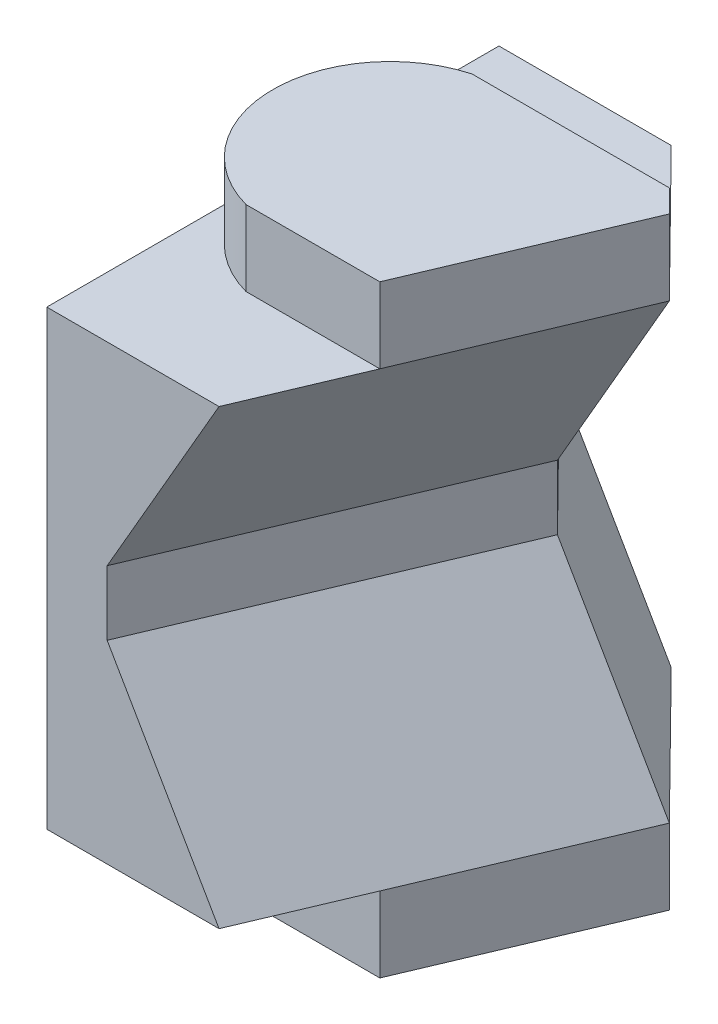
ISO-10303-21;
HEADER;
FILE_DESCRIPTION(('STEP AP214'),'2;1');
FILE_NAME('part.step','',(''),(''),'','','');
FILE_SCHEMA(('AUTOMOTIVE_DESIGN { 1 0 10303 214 1 1 1 1 }'));
ENDSEC;
DATA;
#1=APPLICATION_CONTEXT('core data for automotive mechanical design processes');
#2=APPLICATION_PROTOCOL_DEFINITION('international standard','automotive_design',2000,#1);
#3=PRODUCT_CONTEXT('',#1,'mechanical');
#4=PRODUCT('Part','Part','',(#3));
#5=PRODUCT_RELATED_PRODUCT_CATEGORY('part','',(#4));
#6=PRODUCT_DEFINITION_FORMATION('','',#4);
#7=PRODUCT_DEFINITION_CONTEXT('part definition',#1,'design');
#8=PRODUCT_DEFINITION('design','',#6,#7);
#9=PRODUCT_DEFINITION_SHAPE('','',#8);
#10=(LENGTH_UNIT() NAMED_UNIT(*) SI_UNIT(.MILLI.,.METRE.));
#11=(NAMED_UNIT(*) PLANE_ANGLE_UNIT() SI_UNIT($,.RADIAN.));
#12=(NAMED_UNIT(*) SI_UNIT($,.STERADIAN.) SOLID_ANGLE_UNIT());
#13=UNCERTAINTY_MEASURE_WITH_UNIT(LENGTH_MEASURE(1.E-05),#10,'distance_accuracy_value','');
#14=(GEOMETRIC_REPRESENTATION_CONTEXT(3) GLOBAL_UNCERTAINTY_ASSIGNED_CONTEXT((#13)) GLOBAL_UNIT_ASSIGNED_CONTEXT((#10,
#11,#12)) REPRESENTATION_CONTEXT('',''));
#15=CARTESIAN_POINT('',(0.,0.,0.));
#16=DIRECTION('',(0.,0.,1.));
#17=DIRECTION('',(1.,0.,0.));
#18=AXIS2_PLACEMENT_3D('',#15,#16,#17);
#19=CARTESIAN_POINT('',(0.,21.,42.));
#20=DIRECTION('',(0.,-1.,0.));
#21=DIRECTION('',(0.,0.,1.));
#22=AXIS2_PLACEMENT_3D('',#19,#20,#21);
#23=PLANE('',#22);
#24=DIRECTION('',(-0.389123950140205,0.,0.921185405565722));
#25=VECTOR('',#24,1.);
#26=CARTESIAN_POINT('',(28.4209180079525,21.,12.5955688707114));
#27=LINE('',#26,#25);
#28=CARTESIAN_POINT('',(16.,21.,42.));
#29=VERTEX_POINT('',#28);
#30=CARTESIAN_POINT('',(20.4353736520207,21.,31.5));
#31=VERTEX_POINT('',#30);
#32=EDGE_CURVE('E276',#29,#31,#27,.F.);
#33=ORIENTED_EDGE('',*,*,#32,.T.);
#34=DIRECTION('',(-1.,0.,0.));
#35=VECTOR('',#34,1.);
#36=CARTESIAN_POINT('',(8.,21.,31.5));
#37=LINE('',#36,#35);
#38=CARTESIAN_POINT('',(8.,21.,31.5));
#39=VERTEX_POINT('',#38);
#40=EDGE_CURVE('E250',#31,#39,#37,.T.);
#41=ORIENTED_EDGE('',*,*,#40,.T.);
#42=CARTESIAN_POINT('',(10.8906249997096,21.,21.));
#43=DIRECTION('',(0.,-1.,0.));
#44=DIRECTION('',(0.,0.,-1.));
#45=AXIS2_PLACEMENT_3D('',#42,#43,#44);
#46=CIRCLE('',#45,10.8906249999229);
#47=CARTESIAN_POINT('',(-2.133310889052E-10,21.,21.));
#48=VERTEX_POINT('',#47);
#49=EDGE_CURVE('E25',#39,#48,#46,.T.);
#50=ORIENTED_EDGE('',*,*,#49,.T.);
#51=DIRECTION('',(0.,0.,1.));
#52=VECTOR('',#51,1.);
#53=CARTESIAN_POINT('',(0.,21.,42.));
#54=LINE('',#53,#52);
#55=CARTESIAN_POINT('',(0.,21.,42.));
#56=VERTEX_POINT('',#55);
#57=EDGE_CURVE('E204',#48,#56,#54,.T.);
#58=ORIENTED_EDGE('',*,*,#57,.T.);
#59=DIRECTION('',(-1.,0.,0.));
#60=VECTOR('',#59,1.);
#61=CARTESIAN_POINT('',(0.,21.,42.));
#62=LINE('',#61,#60);
#63=EDGE_CURVE('E231',#56,#29,#62,.F.);
#64=ORIENTED_EDGE('',*,*,#63,.T.);
#65=EDGE_LOOP('',(#33,#41,#50,#58,#64));
#66=FACE_BOUND('',#65,.T.);
#67=ADVANCED_FACE('F14',(#66),#23,.F.);
#68=CARTESIAN_POINT('',(0.,-21.,42.));
#69=DIRECTION('',(0.,1.,0.));
#70=DIRECTION('',(0.,0.,1.));
#71=AXIS2_PLACEMENT_3D('',#68,#69,#70);
#72=PLANE('',#71);
#73=DIRECTION('',(1.,0.,0.));
#74=VECTOR('',#73,1.);
#75=CARTESIAN_POINT('',(8.,-21.,10.5));
#76=LINE('',#75,#74);
#77=CARTESIAN_POINT('',(8.,-21.,10.5));
#78=VERTEX_POINT('',#77);
#79=CARTESIAN_POINT('',(26.354406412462,-21.,10.5));
#80=VERTEX_POINT('',#79);
#81=EDGE_CURVE('E40',#78,#80,#76,.T.);
#82=ORIENTED_EDGE('',*,*,#81,.F.);
#83=CARTESIAN_POINT('',(10.8906249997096,-21.,21.));
#84=DIRECTION('',(0.,-1.,0.));
#85=DIRECTION('',(0.,0.,-1.));
#86=AXIS2_PLACEMENT_3D('',#83,#84,#85);
#87=CIRCLE('',#86,10.8906249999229);
#88=CARTESIAN_POINT('',(0.,-21.,21.));
#89=VERTEX_POINT('',#88);
#90=EDGE_CURVE('E23',#89,#78,#87,.T.);
#91=ORIENTED_EDGE('',*,*,#90,.F.);
#92=DIRECTION('',(0.,0.,-1.));
#93=VECTOR('',#92,1.);
#94=CARTESIAN_POINT('',(0.,-21.,42.));
#95=LINE('',#94,#93);
#96=CARTESIAN_POINT('',(0.,-21.,0.));
#97=VERTEX_POINT('',#96);
#98=EDGE_CURVE('E266',#97,#89,#95,.F.);
#99=ORIENTED_EDGE('',*,*,#98,.F.);
#100=DIRECTION('',(1.,0.,0.));
#101=VECTOR('',#100,1.);
#102=CARTESIAN_POINT('',(0.,-21.,0.));
#103=LINE('',#102,#101);
#104=CARTESIAN_POINT('',(16.,-21.,0.));
#105=VERTEX_POINT('',#104);
#106=EDGE_CURVE('E264',#105,#97,#103,.F.);
#107=ORIENTED_EDGE('',*,*,#106,.F.);
#108=DIRECTION('',(0.702153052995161,0.,0.712026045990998));
#109=VECTOR('',#108,1.);
#110=CARTESIAN_POINT('',(10.8763971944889,-21.,-5.19564592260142));
#111=LINE('',#110,#109);
#112=EDGE_CURVE('E262',#80,#105,#111,.F.);
#113=ORIENTED_EDGE('',*,*,#112,.F.);
#114=EDGE_LOOP('',(#82,#91,#99,#107,#113));
#115=FACE_BOUND('',#114,.T.);
#116=ADVANCED_FACE('F323',(#115),#72,.F.);
#117=CARTESIAN_POINT('',(8.,-21.,31.5));
#118=VERTEX_POINT('',#117);
#119=EDGE_CURVE('E192',#118,#89,#87,.T.);
#120=ORIENTED_EDGE('',*,*,#119,.F.);
#121=DIRECTION('',(-1.,0.,0.));
#122=VECTOR('',#121,1.);
#123=CARTESIAN_POINT('',(8.,-21.,31.5));
#124=LINE('',#123,#122);
#125=CARTESIAN_POINT('',(20.4353736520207,-21.,31.5));
#126=VERTEX_POINT('',#125);
#127=EDGE_CURVE('E238',#126,#118,#124,.T.);
#128=ORIENTED_EDGE('',*,*,#127,.F.);
#129=DIRECTION('',(0.389123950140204,0.,-0.921185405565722));
#130=VECTOR('',#129,1.);
#131=CARTESIAN_POINT('',(16.,-21.,42.));
#132=LINE('',#131,#130);
#133=CARTESIAN_POINT('',(16.,-21.,42.));
#134=VERTEX_POINT('',#133);
#135=EDGE_CURVE('E256',#134,#126,#132,.T.);
#136=ORIENTED_EDGE('',*,*,#135,.F.);
#137=DIRECTION('',(1.,0.,0.));
#138=VECTOR('',#137,1.);
#139=CARTESIAN_POINT('',(5.60769515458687,-21.,42.));
#140=LINE('',#139,#138);
#141=CARTESIAN_POINT('',(0.,-21.,42.));
#142=VERTEX_POINT('',#141);
#143=EDGE_CURVE('E191',#142,#134,#140,.T.);
#144=ORIENTED_EDGE('',*,*,#143,.F.);
#145=DIRECTION('',(0.,0.,-1.));
#146=VECTOR('',#145,1.);
#147=CARTESIAN_POINT('',(0.,-21.,42.));
#148=LINE('',#147,#146);
#149=EDGE_CURVE('E215',#89,#142,#148,.F.);
#150=ORIENTED_EDGE('',*,*,#149,.F.);
#151=EDGE_LOOP('',(#120,#128,#136,#144,#150));
#152=FACE_BOUND('',#151,.T.);
#153=ADVANCED_FACE('F327',(#152),#72,.F.);
#154=CARTESIAN_POINT('',(5.60769515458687,-3.,42.));
#155=DIRECTION('',(0.,0.,-1.));
#156=DIRECTION('',(0.,1.,0.));
#157=AXIS2_PLACEMENT_3D('',#154,#155,#156);
#158=PLANE('',#157);
#159=DIRECTION('',(-0.5,0.866025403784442,0.));
#160=VECTOR('',#159,1.);
#161=CARTESIAN_POINT('',(16.,-21.,42.));
#162=LINE('',#161,#160);
#163=CARTESIAN_POINT('',(5.60769515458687,-3.,42.));
#164=VERTEX_POINT('',#163);
#165=EDGE_CURVE('E216',#134,#164,#162,.T.);
#166=ORIENTED_EDGE('',*,*,#165,.T.);
#167=DIRECTION('',(0.,-1.,0.));
#168=VECTOR('',#167,1.);
#169=CARTESIAN_POINT('',(5.60769515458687,0.,42.));
#170=LINE('',#169,#168);
#171=CARTESIAN_POINT('',(5.60769515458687,3.,42.));
#172=VERTEX_POINT('',#171);
#173=EDGE_CURVE('E234',#172,#164,#170,.T.);
#174=ORIENTED_EDGE('',*,*,#173,.F.);
#175=DIRECTION('',(-0.5,-0.866025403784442,0.));
#176=VECTOR('',#175,1.);
#177=CARTESIAN_POINT('',(16.,21.,42.));
#178=LINE('',#177,#176);
#179=EDGE_CURVE('E201',#29,#172,#178,.T.);
#180=ORIENTED_EDGE('',*,*,#179,.F.);
#181=ORIENTED_EDGE('',*,*,#63,.F.);
#182=DIRECTION('',(0.,1.,0.));
#183=VECTOR('',#182,1.);
#184=CARTESIAN_POINT('',(0.,-21.,42.));
#185=LINE('',#184,#183);
#186=EDGE_CURVE('E212',#142,#56,#185,.T.);
#187=ORIENTED_EDGE('',*,*,#186,.F.);
#188=ORIENTED_EDGE('',*,*,#143,.T.);
#189=EDGE_LOOP('',(#166,#174,#180,#181,#187,#188));
#190=FACE_BOUND('',#189,.T.);
#191=ADVANCED_FACE('F351',(#190),#158,.F.);
#192=CARTESIAN_POINT('',(0.,-3.,42.));
#193=DIRECTION('',(1.,0.,0.));
#194=DIRECTION('',(0.,0.,-1.));
#195=AXIS2_PLACEMENT_3D('',#192,#193,#194);
#196=PLANE('',#195);
#197=ORIENTED_EDGE('',*,*,#186,.T.);
#198=ORIENTED_EDGE('',*,*,#57,.F.);
#199=DIRECTION('',(0.,0.,1.));
#200=VECTOR('',#199,1.);
#201=CARTESIAN_POINT('',(0.,21.,42.));
#202=LINE('',#201,#200);
#203=CARTESIAN_POINT('',(0.,21.,0.));
#204=VERTEX_POINT('',#203);
#205=EDGE_CURVE('E285',#204,#48,#202,.T.);
#206=ORIENTED_EDGE('',*,*,#205,.F.);
#207=DIRECTION('',(0.,1.,0.));
#208=VECTOR('',#207,1.);
#209=CARTESIAN_POINT('',(0.,-21.,0.));
#210=LINE('',#209,#208);
#211=EDGE_CURVE('E224',#97,#204,#210,.T.);
#212=ORIENTED_EDGE('',*,*,#211,.F.);
#213=ORIENTED_EDGE('',*,*,#98,.T.);
#214=ORIENTED_EDGE('',*,*,#149,.T.);
#215=EDGE_LOOP('',(#197,#198,#206,#212,#213,#214));
#216=FACE_BOUND('',#215,.T.);
#217=ADVANCED_FACE('F332',(#216),#196,.F.);
#218=CARTESIAN_POINT('',(18.0286131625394,-3.,12.5955688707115));
#219=DIRECTION('',(-0.813312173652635,-0.469566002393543,-0.343556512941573));
#220=DIRECTION('',(0.5,-0.866025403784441,0.));
#221=AXIS2_PLACEMENT_3D('',#218,#219,#220);
#222=PLANE('',#221);
#223=DIRECTION('',(-0.5,0.86602540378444,0.));
#224=VECTOR('',#223,1.);
#225=CARTESIAN_POINT('',(28.4209180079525,-21.,12.5955688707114));
#226=LINE('',#225,#224);
#227=CARTESIAN_POINT('',(28.4209180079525,-21.,12.5955688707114));
#228=VERTEX_POINT('',#227);
#229=CARTESIAN_POINT('',(18.0286131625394,-3.,12.5955688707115));
#230=VERTEX_POINT('',#229);
#231=EDGE_CURVE('E219',#228,#230,#226,.T.);
#232=ORIENTED_EDGE('',*,*,#231,.T.);
#233=DIRECTION('',(-0.389123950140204,0.,0.921185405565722));
#234=VECTOR('',#233,1.);
#235=CARTESIAN_POINT('',(5.60769515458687,-3.,42.));
#236=LINE('',#235,#234);
#237=EDGE_CURVE('E226',#164,#230,#236,.F.);
#238=ORIENTED_EDGE('',*,*,#237,.F.);
#239=ORIENTED_EDGE('',*,*,#165,.F.);
#240=ORIENTED_EDGE('',*,*,#135,.T.);
#241=DIRECTION('',(-0.389123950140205,0.,0.921185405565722));
#242=VECTOR('',#241,1.);
#243=CARTESIAN_POINT('',(20.4353736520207,-21.,31.5));
#244=LINE('',#243,#242);
#245=EDGE_CURVE('E149',#228,#126,#244,.T.);
#246=ORIENTED_EDGE('',*,*,#245,.F.);
#247=EDGE_LOOP('',(#232,#238,#239,#240,#246));
#248=FACE_BOUND('',#247,.T.);
#249=ADVANCED_FACE('F346',(#248),#222,.F.);
#250=CARTESIAN_POINT('',(5.60769515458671,-3.,0.));
#251=DIRECTION('',(-0.658551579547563,-0.380214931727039,0.649420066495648));
#252=DIRECTION('',(0.702153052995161,0.,0.712026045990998));
#253=AXIS2_PLACEMENT_3D('',#250,#251,#252);
#254=PLANE('',#253);
#255=DIRECTION('',(-0.5,0.866025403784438,0.));
#256=VECTOR('',#255,1.);
#257=CARTESIAN_POINT('',(16.,-21.,0.));
#258=LINE('',#257,#256);
#259=CARTESIAN_POINT('',(5.60769515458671,-3.,0.));
#260=VERTEX_POINT('',#259);
#261=EDGE_CURVE('E222',#105,#260,#258,.T.);
#262=ORIENTED_EDGE('',*,*,#261,.T.);
#263=DIRECTION('',(0.702153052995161,0.,0.712026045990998));
#264=VECTOR('',#263,1.);
#265=CARTESIAN_POINT('',(18.0286131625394,-3.,12.5955688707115));
#266=LINE('',#265,#264);
#267=EDGE_CURVE('E237',#230,#260,#266,.F.);
#268=ORIENTED_EDGE('',*,*,#267,.F.);
#269=ORIENTED_EDGE('',*,*,#231,.F.);
#270=DIRECTION('',(0.702153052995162,0.,0.712026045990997));
#271=VECTOR('',#270,1.);
#272=CARTESIAN_POINT('',(28.4209180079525,-21.,12.5955688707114));
#273=LINE('',#272,#271);
#274=EDGE_CURVE('E259',#80,#228,#273,.T.);
#275=ORIENTED_EDGE('',*,*,#274,.F.);
#276=ORIENTED_EDGE('',*,*,#112,.T.);
#277=EDGE_LOOP('',(#262,#268,#269,#275,#276));
#278=FACE_BOUND('',#277,.T.);
#279=ADVANCED_FACE('F314',(#278),#254,.F.);
#280=CARTESIAN_POINT('',(0.,-3.,0.));
#281=DIRECTION('',(0.,0.,1.));
#282=DIRECTION('',(1.,0.,0.));
#283=AXIS2_PLACEMENT_3D('',#280,#281,#282);
#284=PLANE('',#283);
#285=ORIENTED_EDGE('',*,*,#211,.T.);
#286=DIRECTION('',(-1.,0.,0.));
#287=VECTOR('',#286,1.);
#288=CARTESIAN_POINT('',(0.,21.,0.));
#289=LINE('',#288,#287);
#290=CARTESIAN_POINT('',(16.,21.,0.));
#291=VERTEX_POINT('',#290);
#292=EDGE_CURVE('E282',#291,#204,#289,.T.);
#293=ORIENTED_EDGE('',*,*,#292,.F.);
#294=DIRECTION('',(-0.5,-0.866025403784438,0.));
#295=VECTOR('',#294,1.);
#296=CARTESIAN_POINT('',(16.,21.,0.));
#297=LINE('',#296,#295);
#298=CARTESIAN_POINT('',(5.60769515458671,3.,0.));
#299=VERTEX_POINT('',#298);
#300=EDGE_CURVE('E208',#291,#299,#297,.T.);
#301=ORIENTED_EDGE('',*,*,#300,.T.);
#302=DIRECTION('',(0.,-1.,0.));
#303=VECTOR('',#302,1.);
#304=CARTESIAN_POINT('',(5.60769515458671,0.,0.));
#305=LINE('',#304,#303);
#306=EDGE_CURVE('E227',#299,#260,#305,.T.);
#307=ORIENTED_EDGE('',*,*,#306,.T.);
#308=ORIENTED_EDGE('',*,*,#261,.F.);
#309=ORIENTED_EDGE('',*,*,#106,.T.);
#310=EDGE_LOOP('',(#285,#293,#301,#307,#308,#309));
#311=FACE_BOUND('',#310,.T.);
#312=ADVANCED_FACE('F16',(#311),#284,.F.);
#313=CARTESIAN_POINT('',(5.60769515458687,0.,42.));
#314=DIRECTION('',(-0.921185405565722,0.,-0.389123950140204));
#315=DIRECTION('',(-0.389123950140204,0.,0.921185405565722));
#316=AXIS2_PLACEMENT_3D('',#313,#314,#315);
#317=PLANE('',#316);
#318=ORIENTED_EDGE('',*,*,#237,.T.);
#319=DIRECTION('',(0.,-1.,0.));
#320=VECTOR('',#319,1.);
#321=CARTESIAN_POINT('',(18.0286131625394,0.,12.5955688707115));
#322=LINE('',#321,#320);
#323=CARTESIAN_POINT('',(18.0286131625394,3.,12.5955688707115));
#324=VERTEX_POINT('',#323);
#325=EDGE_CURVE('E230',#324,#230,#322,.T.);
#326=ORIENTED_EDGE('',*,*,#325,.F.);
#327=DIRECTION('',(-0.389123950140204,0.,0.921185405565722));
#328=VECTOR('',#327,1.);
#329=CARTESIAN_POINT('',(18.0286131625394,3.,12.5955688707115));
#330=LINE('',#329,#328);
#331=EDGE_CURVE('E211',#172,#324,#330,.F.);
#332=ORIENTED_EDGE('',*,*,#331,.F.);
#333=ORIENTED_EDGE('',*,*,#173,.T.);
#334=EDGE_LOOP('',(#318,#326,#332,#333));
#335=FACE_BOUND('',#334,.T.);
#336=ADVANCED_FACE('F348',(#335),#317,.F.);
#337=CARTESIAN_POINT('',(18.0286131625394,0.,12.5955688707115));
#338=DIRECTION('',(-0.712026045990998,0.,0.702153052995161));
#339=DIRECTION('',(0.702153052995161,0.,0.712026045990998));
#340=AXIS2_PLACEMENT_3D('',#337,#338,#339);
#341=PLANE('',#340);
#342=ORIENTED_EDGE('',*,*,#267,.T.);
#343=ORIENTED_EDGE('',*,*,#306,.F.);
#344=DIRECTION('',(0.702153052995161,0.,0.712026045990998));
#345=VECTOR('',#344,1.);
#346=CARTESIAN_POINT('',(5.60769515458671,3.,0.));
#347=LINE('',#346,#345);
#348=EDGE_CURVE('E246',#324,#299,#347,.F.);
#349=ORIENTED_EDGE('',*,*,#348,.F.);
#350=ORIENTED_EDGE('',*,*,#325,.T.);
#351=EDGE_LOOP('',(#342,#343,#349,#350));
#352=FACE_BOUND('',#351,.T.);
#353=ADVANCED_FACE('F345',(#352),#341,.F.);
#354=ORIENTED_EDGE('',*,*,#205,.T.);
#355=CARTESIAN_POINT('',(8.,21.,10.5));
#356=VERTEX_POINT('',#355);
#357=EDGE_CURVE('E9',#48,#356,#46,.T.);
#358=ORIENTED_EDGE('',*,*,#357,.T.);
#359=DIRECTION('',(1.,0.,0.));
#360=VECTOR('',#359,1.);
#361=CARTESIAN_POINT('',(8.,21.,10.5));
#362=LINE('',#361,#360);
#363=CARTESIAN_POINT('',(26.354406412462,21.,10.5));
#364=VERTEX_POINT('',#363);
#365=EDGE_CURVE('E172',#356,#364,#362,.T.);
#366=ORIENTED_EDGE('',*,*,#365,.T.);
#367=DIRECTION('',(0.70215305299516,0.,0.712026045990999));
#368=VECTOR('',#367,1.);
#369=CARTESIAN_POINT('',(16.,21.,0.));
#370=LINE('',#369,#368);
#371=EDGE_CURVE('E280',#364,#291,#370,.F.);
#372=ORIENTED_EDGE('',*,*,#371,.T.);
#373=ORIENTED_EDGE('',*,*,#292,.T.);
#374=EDGE_LOOP('',(#354,#358,#366,#372,#373));
#375=FACE_BOUND('',#374,.T.);
#376=ADVANCED_FACE('F338',(#375),#23,.F.);
#377=CARTESIAN_POINT('',(18.0286131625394,3.,12.5955688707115));
#378=DIRECTION('',(-0.813312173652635,0.469566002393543,-0.343556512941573));
#379=DIRECTION('',(0.5,0.866025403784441,0.));
#380=AXIS2_PLACEMENT_3D('',#377,#378,#379);
#381=PLANE('',#380);
#382=DIRECTION('',(-0.5,-0.86602540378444,0.));
#383=VECTOR('',#382,1.);
#384=CARTESIAN_POINT('',(28.4209180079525,21.,12.5955688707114));
#385=LINE('',#384,#383);
#386=CARTESIAN_POINT('',(28.4209180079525,21.,12.5955688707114));
#387=VERTEX_POINT('',#386);
#388=EDGE_CURVE('E205',#387,#324,#385,.T.);
#389=ORIENTED_EDGE('',*,*,#388,.F.);
#390=DIRECTION('',(0.389123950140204,0.,-0.921185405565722));
#391=VECTOR('',#390,1.);
#392=CARTESIAN_POINT('',(16.,21.,42.));
#393=LINE('',#392,#391);
#394=EDGE_CURVE('E18',#387,#31,#393,.F.);
#395=ORIENTED_EDGE('',*,*,#394,.T.);
#396=ORIENTED_EDGE('',*,*,#32,.F.);
#397=ORIENTED_EDGE('',*,*,#179,.T.);
#398=ORIENTED_EDGE('',*,*,#331,.T.);
#399=EDGE_LOOP('',(#389,#395,#396,#397,#398));
#400=FACE_BOUND('',#399,.T.);
#401=ADVANCED_FACE('F368',(#400),#381,.F.);
#402=CARTESIAN_POINT('',(5.60769515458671,3.,0.));
#403=DIRECTION('',(-0.658551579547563,0.380214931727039,0.649420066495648));
#404=DIRECTION('',(0.702153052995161,0.,0.712026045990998));
#405=AXIS2_PLACEMENT_3D('',#402,#403,#404);
#406=PLANE('',#405);
#407=ORIENTED_EDGE('',*,*,#300,.F.);
#408=ORIENTED_EDGE('',*,*,#371,.F.);
#409=DIRECTION('',(0.702153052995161,0.,0.712026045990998));
#410=VECTOR('',#409,1.);
#411=CARTESIAN_POINT('',(10.8763971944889,21.,-5.19564592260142));
#412=LINE('',#411,#410);
#413=EDGE_CURVE('E32',#364,#387,#412,.T.);
#414=ORIENTED_EDGE('',*,*,#413,.T.);
#415=ORIENTED_EDGE('',*,*,#388,.T.);
#416=ORIENTED_EDGE('',*,*,#348,.T.);
#417=EDGE_LOOP('',(#407,#408,#414,#415,#416));
#418=FACE_BOUND('',#417,.T.);
#419=ADVANCED_FACE('F342',(#418),#406,.F.);
#420=CARTESIAN_POINT('',(28.4209180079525,-28.,12.5955688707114));
#421=DIRECTION('',(-0.712026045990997,0.,0.702153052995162));
#422=DIRECTION('',(0.702153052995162,0.,0.712026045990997));
#423=AXIS2_PLACEMENT_3D('',#420,#421,#422);
#424=PLANE('',#423);
#425=ORIENTED_EDGE('',*,*,#274,.T.);
#426=DIRECTION('',(0.,1.,0.));
#427=VECTOR('',#426,1.);
#428=CARTESIAN_POINT('',(28.4209180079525,-28.,12.5955688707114));
#429=LINE('',#428,#427);
#430=CARTESIAN_POINT('',(28.4209180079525,-28.,12.5955688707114));
#431=VERTEX_POINT('',#430);
#432=EDGE_CURVE('E243',#431,#228,#429,.T.);
#433=ORIENTED_EDGE('',*,*,#432,.F.);
#434=DIRECTION('',(0.702153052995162,0.,0.712026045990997));
#435=VECTOR('',#434,1.);
#436=CARTESIAN_POINT('',(28.4209180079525,-28.,12.5955688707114));
#437=LINE('',#436,#435);
#438=CARTESIAN_POINT('',(26.354406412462,-28.,10.5));
#439=VERTEX_POINT('',#438);
#440=EDGE_CURVE('E178',#439,#431,#437,.T.);
#441=ORIENTED_EDGE('',*,*,#440,.F.);
#442=DIRECTION('',(0.,1.,0.));
#443=VECTOR('',#442,1.);
#444=CARTESIAN_POINT('',(26.354406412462,-28.,10.5));
#445=LINE('',#444,#443);
#446=EDGE_CURVE('E189',#439,#80,#445,.T.);
#447=ORIENTED_EDGE('',*,*,#446,.T.);
#448=EDGE_LOOP('',(#425,#433,#441,#447));
#449=FACE_BOUND('',#448,.T.);
#450=ADVANCED_FACE('F311',(#449),#424,.F.);
#451=CARTESIAN_POINT('',(20.4353736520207,-28.,31.5));
#452=DIRECTION('',(-0.921185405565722,0.,-0.389123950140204));
#453=DIRECTION('',(-0.389123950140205,0.,0.921185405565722));
#454=AXIS2_PLACEMENT_3D('',#451,#452,#453);
#455=PLANE('',#454);
#456=ORIENTED_EDGE('',*,*,#245,.T.);
#457=DIRECTION('',(0.,1.,0.));
#458=VECTOR('',#457,1.);
#459=CARTESIAN_POINT('',(20.4353736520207,-28.,31.5));
#460=LINE('',#459,#458);
#461=CARTESIAN_POINT('',(20.4353736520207,-28.,31.5));
#462=VERTEX_POINT('',#461);
#463=EDGE_CURVE('E200',#462,#126,#460,.T.);
#464=ORIENTED_EDGE('',*,*,#463,.F.);
#465=DIRECTION('',(-0.389123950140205,0.,0.921185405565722));
#466=VECTOR('',#465,1.);
#467=CARTESIAN_POINT('',(20.4353736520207,-28.,31.5));
#468=LINE('',#467,#466);
#469=EDGE_CURVE('E181',#431,#462,#468,.T.);
#470=ORIENTED_EDGE('',*,*,#469,.F.);
#471=ORIENTED_EDGE('',*,*,#432,.T.);
#472=EDGE_LOOP('',(#456,#464,#470,#471));
#473=FACE_BOUND('',#472,.T.);
#474=ADVANCED_FACE('F295',(#473),#455,.F.);
#475=CARTESIAN_POINT('',(8.,-28.,31.5));
#476=DIRECTION('',(0.,0.,-1.));
#477=DIRECTION('',(-1.,0.,0.));
#478=AXIS2_PLACEMENT_3D('',#475,#476,#477);
#479=PLANE('',#478);
#480=ORIENTED_EDGE('',*,*,#127,.T.);
#481=DIRECTION('',(0.,1.,0.));
#482=VECTOR('',#481,1.);
#483=CARTESIAN_POINT('',(8.,-28.,31.5));
#484=LINE('',#483,#482);
#485=CARTESIAN_POINT('',(8.,-28.,31.5));
#486=VERTEX_POINT('',#485);
#487=EDGE_CURVE('E197',#486,#118,#484,.T.);
#488=ORIENTED_EDGE('',*,*,#487,.F.);
#489=DIRECTION('',(-1.,0.,0.));
#490=VECTOR('',#489,1.);
#491=CARTESIAN_POINT('',(8.,-28.,31.5));
#492=LINE('',#491,#490);
#493=EDGE_CURVE('E183',#462,#486,#492,.T.);
#494=ORIENTED_EDGE('',*,*,#493,.F.);
#495=ORIENTED_EDGE('',*,*,#463,.T.);
#496=EDGE_LOOP('',(#480,#488,#494,#495));
#497=FACE_BOUND('',#496,.T.);
#498=ADVANCED_FACE('F301',(#497),#479,.F.);
#499=CARTESIAN_POINT('',(10.8906249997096,-28.,21.));
#500=DIRECTION('',(0.,1.,0.));
#501=DIRECTION('',(0.,0.,1.));
#502=AXIS2_PLACEMENT_3D('',#499,#500,#501);
#503=CYLINDRICAL_SURFACE('',#502,10.8906249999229);
#504=ORIENTED_EDGE('',*,*,#119,.T.);
#505=ORIENTED_EDGE('',*,*,#90,.T.);
#506=DIRECTION('',(0.,1.,0.));
#507=VECTOR('',#506,1.);
#508=CARTESIAN_POINT('',(8.,-28.,10.5));
#509=LINE('',#508,#507);
#510=CARTESIAN_POINT('',(8.,-28.,10.5));
#511=VERTEX_POINT('',#510);
#512=EDGE_CURVE('E194',#511,#78,#509,.T.);
#513=ORIENTED_EDGE('',*,*,#512,.F.);
#514=CARTESIAN_POINT('',(10.8906249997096,-28.,21.));
#515=DIRECTION('',(0.,-1.,0.));
#516=DIRECTION('',(0.,0.,-1.));
#517=AXIS2_PLACEMENT_3D('',#514,#515,#516);
#518=CIRCLE('',#517,10.8906249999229);
#519=EDGE_CURVE('E185',#486,#511,#518,.T.);
#520=ORIENTED_EDGE('',*,*,#519,.F.);
#521=ORIENTED_EDGE('',*,*,#487,.T.);
#522=EDGE_LOOP('',(#504,#505,#513,#520,#521));
#523=FACE_BOUND('',#522,.T.);
#524=ADVANCED_FACE('F320',(#523),#503,.T.);
#525=CARTESIAN_POINT('',(8.,-28.,10.5));
#526=DIRECTION('',(0.,0.,1.));
#527=DIRECTION('',(1.,0.,0.));
#528=AXIS2_PLACEMENT_3D('',#525,#526,#527);
#529=PLANE('',#528);
#530=ORIENTED_EDGE('',*,*,#81,.T.);
#531=ORIENTED_EDGE('',*,*,#446,.F.);
#532=DIRECTION('',(1.,0.,0.));
#533=VECTOR('',#532,1.);
#534=CARTESIAN_POINT('',(8.,-28.,10.5));
#535=LINE('',#534,#533);
#536=EDGE_CURVE('E187',#511,#439,#535,.T.);
#537=ORIENTED_EDGE('',*,*,#536,.F.);
#538=ORIENTED_EDGE('',*,*,#512,.T.);
#539=EDGE_LOOP('',(#530,#531,#537,#538));
#540=FACE_BOUND('',#539,.T.);
#541=ADVANCED_FACE('F317',(#540),#529,.F.);
#542=CARTESIAN_POINT('',(10.8906249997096,-28.,21.));
#543=DIRECTION('',(0.,-1.,0.));
#544=DIRECTION('',(0.,0.,-1.));
#545=AXIS2_PLACEMENT_3D('',#542,#543,#544);
#546=PLANE('',#545);
#547=ORIENTED_EDGE('',*,*,#440,.T.);
#548=ORIENTED_EDGE('',*,*,#469,.T.);
#549=ORIENTED_EDGE('',*,*,#493,.T.);
#550=ORIENTED_EDGE('',*,*,#519,.T.);
#551=ORIENTED_EDGE('',*,*,#536,.T.);
#552=EDGE_LOOP('',(#547,#548,#549,#550,#551));
#553=FACE_BOUND('',#552,.T.);
#554=ADVANCED_FACE('F305',(#553),#546,.T.);
#555=CARTESIAN_POINT('',(28.4209180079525,28.,12.5955688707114));
#556=DIRECTION('',(0.712026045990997,0.,-0.702153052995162));
#557=DIRECTION('',(-0.702153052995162,0.,-0.712026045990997));
#558=AXIS2_PLACEMENT_3D('',#555,#556,#557);
#559=PLANE('',#558);
#560=ORIENTED_EDGE('',*,*,#413,.F.);
#561=DIRECTION('',(0.,-1.,0.));
#562=VECTOR('',#561,1.);
#563=CARTESIAN_POINT('',(26.354406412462,28.,10.5));
#564=LINE('',#563,#562);
#565=CARTESIAN_POINT('',(26.354406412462,28.,10.5));
#566=VERTEX_POINT('',#565);
#567=EDGE_CURVE('E140',#566,#364,#564,.T.);
#568=ORIENTED_EDGE('',*,*,#567,.F.);
#569=DIRECTION('',(0.702153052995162,0.,0.712026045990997));
#570=VECTOR('',#569,1.);
#571=CARTESIAN_POINT('',(28.4209180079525,28.,12.5955688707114));
#572=LINE('',#571,#570);
#573=CARTESIAN_POINT('',(28.4209180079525,28.,12.5955688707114));
#574=VERTEX_POINT('',#573);
#575=EDGE_CURVE('E143',#566,#574,#572,.T.);
#576=ORIENTED_EDGE('',*,*,#575,.T.);
#577=DIRECTION('',(0.,-1.,0.));
#578=VECTOR('',#577,1.);
#579=CARTESIAN_POINT('',(28.4209180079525,28.,12.5955688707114));
#580=LINE('',#579,#578);
#581=EDGE_CURVE('E171',#574,#387,#580,.T.);
#582=ORIENTED_EDGE('',*,*,#581,.T.);
#583=EDGE_LOOP('',(#560,#568,#576,#582));
#584=FACE_BOUND('',#583,.T.);
#585=ADVANCED_FACE('F142',(#584),#559,.T.);
#586=CARTESIAN_POINT('',(8.,28.,10.5));
#587=DIRECTION('',(0.,0.,-1.));
#588=DIRECTION('',(-1.,0.,0.));
#589=AXIS2_PLACEMENT_3D('',#586,#587,#588);
#590=PLANE('',#589);
#591=ORIENTED_EDGE('',*,*,#365,.F.);
#592=DIRECTION('',(0.,-1.,0.));
#593=VECTOR('',#592,1.);
#594=CARTESIAN_POINT('',(8.,28.,10.5));
#595=LINE('',#594,#593);
#596=CARTESIAN_POINT('',(8.,28.,10.5));
#597=VERTEX_POINT('',#596);
#598=EDGE_CURVE('E150',#597,#356,#595,.T.);
#599=ORIENTED_EDGE('',*,*,#598,.F.);
#600=DIRECTION('',(1.,0.,0.));
#601=VECTOR('',#600,1.);
#602=CARTESIAN_POINT('',(8.,28.,10.5));
#603=LINE('',#602,#601);
#604=EDGE_CURVE('E156',#597,#566,#603,.T.);
#605=ORIENTED_EDGE('',*,*,#604,.T.);
#606=ORIENTED_EDGE('',*,*,#567,.T.);
#607=EDGE_LOOP('',(#591,#599,#605,#606));
#608=FACE_BOUND('',#607,.T.);
#609=ADVANCED_FACE('F162',(#608),#590,.T.);
#610=CARTESIAN_POINT('',(10.8906249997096,28.,21.));
#611=DIRECTION('',(0.,-1.,0.));
#612=DIRECTION('',(0.,0.,-1.));
#613=AXIS2_PLACEMENT_3D('',#610,#611,#612);
#614=CYLINDRICAL_SURFACE('',#613,10.8906249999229);
#615=ORIENTED_EDGE('',*,*,#49,.F.);
#616=DIRECTION('',(0.,-1.,0.));
#617=VECTOR('',#616,1.);
#618=CARTESIAN_POINT('',(8.,28.,31.5));
#619=LINE('',#618,#617);
#620=CARTESIAN_POINT('',(8.,28.,31.5));
#621=VERTEX_POINT('',#620);
#622=EDGE_CURVE('E174',#621,#39,#619,.T.);
#623=ORIENTED_EDGE('',*,*,#622,.F.);
#624=CARTESIAN_POINT('',(10.8906249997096,28.,21.));
#625=DIRECTION('',(0.,-1.,0.));
#626=DIRECTION('',(0.,0.,-1.));
#627=AXIS2_PLACEMENT_3D('',#624,#625,#626);
#628=CIRCLE('',#627,10.8906249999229);
#629=EDGE_CURVE('E163',#621,#597,#628,.T.);
#630=ORIENTED_EDGE('',*,*,#629,.T.);
#631=ORIENTED_EDGE('',*,*,#598,.T.);
#632=ORIENTED_EDGE('',*,*,#357,.F.);
#633=EDGE_LOOP('',(#615,#623,#630,#631,#632));
#634=FACE_BOUND('',#633,.T.);
#635=ADVANCED_FACE('F359',(#634),#614,.T.);
#636=CARTESIAN_POINT('',(8.,28.,31.5));
#637=DIRECTION('',(0.,0.,1.));
#638=DIRECTION('',(1.,0.,0.));
#639=AXIS2_PLACEMENT_3D('',#636,#637,#638);
#640=PLANE('',#639);
#641=ORIENTED_EDGE('',*,*,#40,.F.);
#642=DIRECTION('',(0.,-1.,0.));
#643=VECTOR('',#642,1.);
#644=CARTESIAN_POINT('',(20.4353736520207,28.,31.5));
#645=LINE('',#644,#643);
#646=CARTESIAN_POINT('',(20.4353736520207,28.,31.5));
#647=VERTEX_POINT('',#646);
#648=EDGE_CURVE('E176',#647,#31,#645,.T.);
#649=ORIENTED_EDGE('',*,*,#648,.F.);
#650=DIRECTION('',(-1.,0.,0.));
#651=VECTOR('',#650,1.);
#652=CARTESIAN_POINT('',(8.,28.,31.5));
#653=LINE('',#652,#651);
#654=EDGE_CURVE('E165',#647,#621,#653,.T.);
#655=ORIENTED_EDGE('',*,*,#654,.T.);
#656=ORIENTED_EDGE('',*,*,#622,.T.);
#657=EDGE_LOOP('',(#641,#649,#655,#656));
#658=FACE_BOUND('',#657,.T.);
#659=ADVANCED_FACE('F361',(#658),#640,.T.);
#660=CARTESIAN_POINT('',(20.4353736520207,28.,31.5));
#661=DIRECTION('',(0.921185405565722,0.,0.389123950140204));
#662=DIRECTION('',(0.389123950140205,0.,-0.921185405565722));
#663=AXIS2_PLACEMENT_3D('',#660,#661,#662);
#664=PLANE('',#663);
#665=ORIENTED_EDGE('',*,*,#394,.F.);
#666=ORIENTED_EDGE('',*,*,#581,.F.);
#667=DIRECTION('',(-0.389123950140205,0.,0.921185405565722));
#668=VECTOR('',#667,1.);
#669=CARTESIAN_POINT('',(20.4353736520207,28.,31.5));
#670=LINE('',#669,#668);
#671=EDGE_CURVE('E160',#574,#647,#670,.T.);
#672=ORIENTED_EDGE('',*,*,#671,.T.);
#673=ORIENTED_EDGE('',*,*,#648,.T.);
#674=EDGE_LOOP('',(#665,#666,#672,#673));
#675=FACE_BOUND('',#674,.T.);
#676=ADVANCED_FACE('F365',(#675),#664,.T.);
#677=CARTESIAN_POINT('',(10.8906249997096,28.,21.));
#678=DIRECTION('',(0.,1.,0.));
#679=DIRECTION('',(0.,0.,-1.));
#680=AXIS2_PLACEMENT_3D('',#677,#678,#679);
#681=PLANE('',#680);
#682=ORIENTED_EDGE('',*,*,#575,.F.);
#683=ORIENTED_EDGE('',*,*,#604,.F.);
#684=ORIENTED_EDGE('',*,*,#629,.F.);
#685=ORIENTED_EDGE('',*,*,#654,.F.);
#686=ORIENTED_EDGE('',*,*,#671,.F.);
#687=EDGE_LOOP('',(#682,#683,#684,#685,#686));
#688=FACE_BOUND('',#687,.T.);
#689=ADVANCED_FACE('F154',(#688),#681,.T.);
#690=CLOSED_SHELL('',(#67,#116,#153,#191,#217,#249,#279,#312,#336,#353,#376,#401,#419,#450,#474,
#498,#524,#541,#554,#585,#609,#635,#659,#676,#689));
#691=MANIFOLD_SOLID_BREP('B1',#690);
#692=ADVANCED_BREP_SHAPE_REPRESENTATION('',(#18,#691),#14);
#693=SHAPE_DEFINITION_REPRESENTATION(#9,#692);
ENDSEC;
END-ISO-10303-21;
